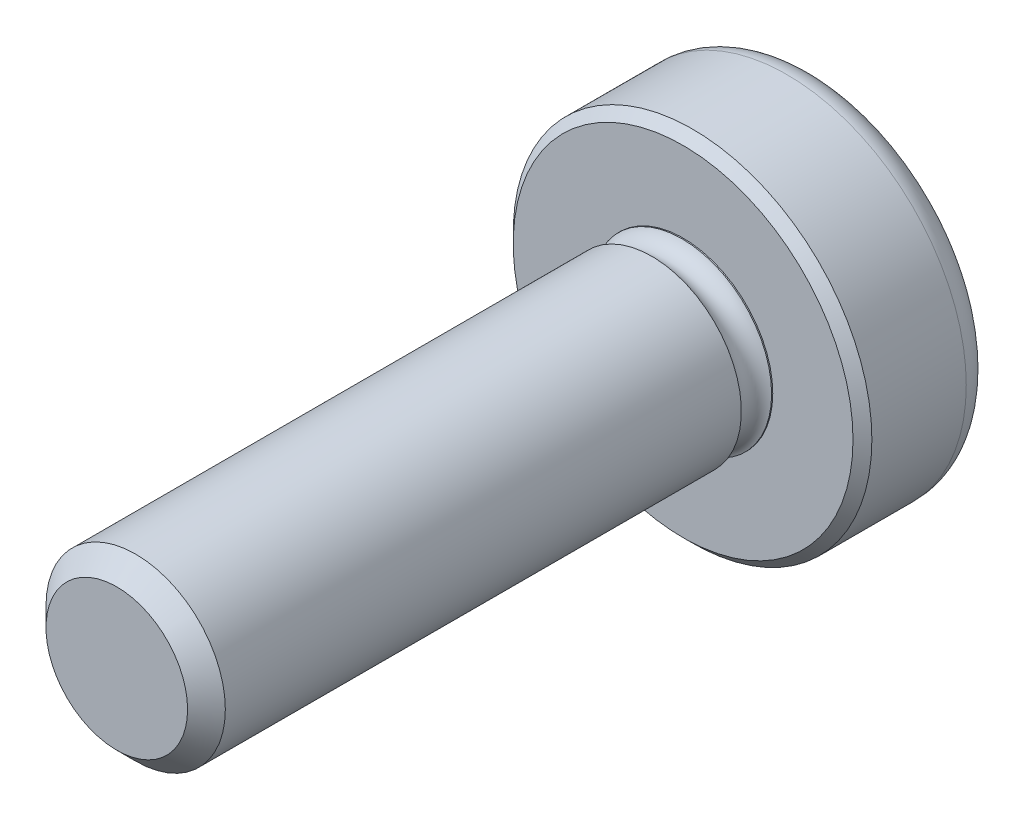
from build123d import *

# Parameters (mm, degrees)
SKETCH1_R           = 1.9
BASE_EXTRUDE_DEPTH  = 1.4
SKETCH2_R           = 0.95
BOSS_EXTRUDE1_DEPTH = 6
CHAMFER1_SIZE       = 0.2
CHAMFER2_SIZE       = 0.1
FILLET1_R           = 0.3
CUT_EXTRUDE1_DEPTH  = 0.5
CUT_EXTRUDE1_DRAFT  = -10
SKETCH4_R           = 0.17220264


with BuildPart() as part:
    # Sketch1 → Base-Extrude (new body)
    with BuildSketch(Plane.XY):
        Circle(SKETCH1_R)
    extrude(amount=BASE_EXTRUDE_DEPTH)

    # Sketch2 → Boss-Extrude1 (add)
    with BuildSketch(Plane.XY.offset(1.4)):
        Circle(SKETCH2_R)
    extrude(amount=BOSS_EXTRUDE1_DEPTH)

    # Chamfer1
    chamfer1_edges = [part.edges().sort_by_distance(p)[0] for p in [
        (-0.95, 0, 7.4),
    ]]
    chamfer(chamfer1_edges, length=CHAMFER1_SIZE)

    # Chamfer2
    chamfer2_edges = [part.edges().sort_by_distance(p)[0] for p in [
        (-1.9, 0, 1.4),
    ]]
    chamfer(chamfer2_edges, length=CHAMFER2_SIZE)

    # Fillet1
    fillet1_edges = [part.edges().sort_by_distance(p)[0] for p in [
        (-1.9, 0, 0),
    ]]
    fillet(fillet1_edges, radius=FILLET1_R)


with BuildPart() as cut_extrude1_tool:
    # Sketch3 → Cut-Extrude1 (with draft: the straight prism first)
    with BuildSketch(Plane(origin=(0, 0, 0), x_dir=(-1, 0, 0), z_dir=(0, 0, -1))):
        Polygon((1.367069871, 0.264203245), (0.247182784, 0.264203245), (0.247182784, 1.371663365), (-0.247182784, 1.371663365), (-0.247182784, 0.264203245), (-1.370752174, 0.264203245), (-1.370752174, -0.264203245), (-0.247182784, -0.264203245), (-0.247182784, -1.373072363), (0.247182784, -1.373072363), (0.247182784, -0.264203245), (1.367069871, -0.264203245), align=None)
    extrude(amount=-CUT_EXTRUDE1_DEPTH)
    # Cut-Extrude1: the draft: its side faces are tilted about the plane it starts from
    cut_extrude1_sides = [cut_extrude1_tool.faces().sort_by_distance(p)[0] for p in [
        (-0.807126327, 0.264203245, 0.25),
        (-0.247182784, 0.817933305, 0.25),
        (0, 1.371663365, 0.25),
        (0.247182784, 0.817933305, 0.25),
        (0.808967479, 0.264203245, 0.25),
        (1.370752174, 0, 0.25),
        (0.808967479, -0.264203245, 0.25),
        (0.247182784, -0.818637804, 0.25),
        (0, -1.373072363, 0.25),
        (-0.247182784, -0.818637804, 0.25),
        (-0.807126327, -0.264203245, 0.25),
        (-1.367069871, 0, 0.25),
    ]]
    draft(cut_extrude1_sides, Plane(origin=(0, 0, 0), x_dir=(-1, 0, 0), z_dir=(0, 0, -1)), CUT_EXTRUDE1_DRAFT)


with BuildPart() as part_1:
    add(part.part)

    # Cut-Extrude1: cut by cut_extrude1_tool
    add(cut_extrude1_tool.part, mode=Mode.SUBTRACT)

    # Sketch4 → Cut-Revolve1 (revolve, cut)
    with BuildSketch(Plane(origin=(0, 0, 0), x_dir=(1, 0, 0), z_dir=(0, 1, 0)), mode=Mode.PRIVATE) as cut_revolve1_sk:
        with Locations((1.012945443, -1.572600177)):
            Circle(SKETCH4_R)
    revolve(cut_revolve1_sk.sketch.rotate(Axis((0, 0, 0), (0, 0, 1)), 180), axis=Axis((0, 0, 0), (0, 0, 1)), mode=Mode.SUBTRACT)


solid = part_1.part
